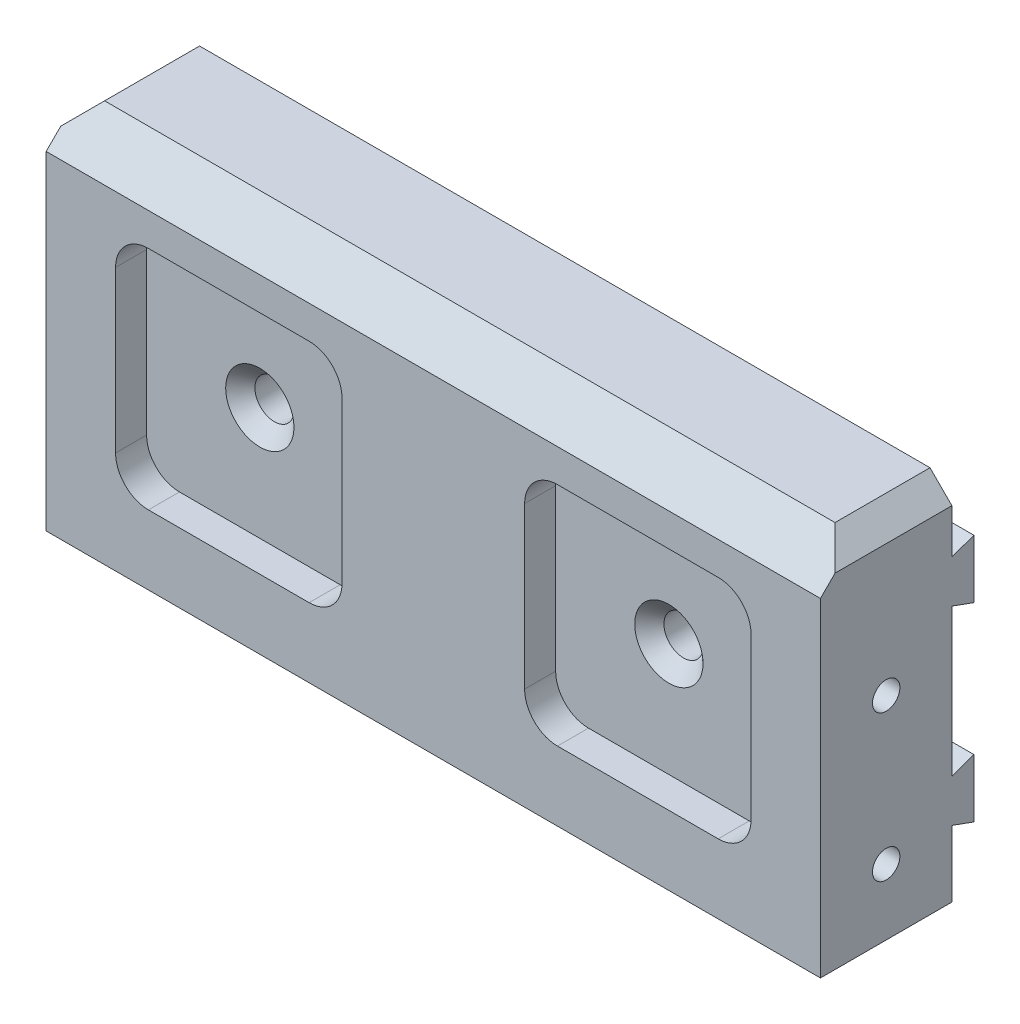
from build123d import *

# Parameters (mm, degrees)
SKETCH_1_W          = 106
SKETCH_1_H          = 50
EXTRUDE_1_DEPTH     = 9
CHAMFER_1_SIZE      = 5
CUT_EXTRUDE_1_DEPTH = 4.25
SKETCH_3_R          = 2.675
CUT_EXTRUDE_2_DEPTH = 62.302528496
CHAMFER_2_SIZE      = 3
EXTRUDE_2_DEPTH     = 106
CHAMFER_3_SIZE      = 3
SKETCH_5_R          = 1.875
CUT_EXTRUDE_4_DEPTH = 20
CHAMFER_4_SIZE      = 2


with BuildPart() as part:
    # Sketch 1 → Extrude 1 (new, symmetric)
    with BuildSketch(Plane.XY):
        Rectangle(SKETCH_1_W, SKETCH_1_H)
    extrude(amount=EXTRUDE_1_DEPTH, both=True)

    # Chamfer 1
    chamfer_1_edges = [part.edges().sort_by_distance(p)[0] for p in [
        (0, 25, 9),
    ]]
    chamfer(chamfer_1_edges, length=CHAMFER_1_SIZE)

    # Sketch 2 → Cut-Extrude 1 (cut)
    with BuildSketch(Plane.XY.offset(9)):
        with BuildLine():
            Line((-12.5, 11), (-12.5, -11))
            ThreePointArc((-12.5, -11), (-13.818019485, -14.181980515), (-17, -15.5))
            Line((-17, -15.5), (-39, -15.5))
            ThreePointArc((-39, -15.5), (-42.181980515, -14.181980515), (-43.5, -11))
            Line((-43.5, -11), (-43.5, 11))
            ThreePointArc((-43.5, 11), (-42.181980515, 14.181980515), (-39, 15.5))
            Line((-39, 15.5), (-17, 15.5))
            ThreePointArc((-17, 15.5), (-13.818019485, 14.181980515), (-12.5, 11))
        make_face()
        with BuildLine():
            Line((43.5, -11), (43.5, 11))
            ThreePointArc((43.5, 11), (42.181980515, 14.181980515), (39, 15.5))
            Line((39, 15.5), (17, 15.5))
            ThreePointArc((17, 15.5), (13.818019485, 14.181980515), (12.5, 11))
            Line((12.5, 11), (12.5, -11))
            ThreePointArc((12.5, -11), (13.818019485, -14.181980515), (17, -15.5))
            Line((17, -15.5), (39, -15.5))
            ThreePointArc((39, -15.5), (42.181980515, -14.181980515), (43.5, -11))
        make_face()
    extrude(amount=-CUT_EXTRUDE_1_DEPTH, mode=Mode.SUBTRACT)

    # Sketch 3 → Cut-Extrude 2 (cut, through all)
    with BuildSketch(Plane(origin=(0, 0, -9), x_dir=(-1, 0, 0), z_dir=(0, 0, -1))):
        with Locations((-28, 0)):
            Circle(SKETCH_3_R)
        with Locations((28, 0)):
            Circle(SKETCH_3_R)
    extrude(amount=-CUT_EXTRUDE_2_DEPTH, mode=Mode.SUBTRACT)

    # Chamfer 2
    chamfer_2_edges = [part.edges().sort_by_distance(p)[0] for p in [
        (30.675, 0, -9),
        (-25.325, 0, -9),
    ]]
    chamfer(chamfer_2_edges, length=CHAMFER_2_SIZE)

    # Sketch 4 → Extrude 2 (add)
    with BuildSketch(Plane.ZY.offset(53)):
        Polygon((-9, 10.091910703), (-12, 9), (-12, 17), (-9, 15.908089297), align=None)
        Polygon((-9, -15.908089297), (-9, -10.091910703), (-12, -9), (-12, -17), align=None)
    extrude(amount=-EXTRUDE_2_DEPTH)

    # Chamfer 3
    chamfer_3_edges = [part.edges().sort_by_distance(p)[0] for p in [
        (-53, 25, -2.5),
        (53, 25, -2.5),
    ]]
    chamfer(chamfer_3_edges, length=CHAMFER_3_SIZE)

    # Sketch 5 → Cut-Extrude 4 (cut)
    with BuildSketch(Plane.ZY.offset(53)):
        with Locations((0, 4)):
            Circle(SKETCH_5_R)
        with Locations((0, -16)):
            Circle(SKETCH_5_R)
    cut_extrude_4 = extrude(amount=-CUT_EXTRUDE_4_DEPTH, mode=Mode.SUBTRACT)

    # Mirror 1: Cut-Extrude 4 across plane
    add(cut_extrude_4.mirror(Plane(origin=(0, 0, 0), x_dir=(0, 0, 1), z_dir=(1, 0, 0))), mode=Mode.SUBTRACT)

    # Chamfer 4
    chamfer_4_edges = [part.edges().sort_by_distance(p)[0] for p in [
        (30.675, 0, 4.75),
        (-25.325, 0, 4.75),
    ]]
    chamfer(chamfer_4_edges, length=CHAMFER_4_SIZE)


solid = part.part
